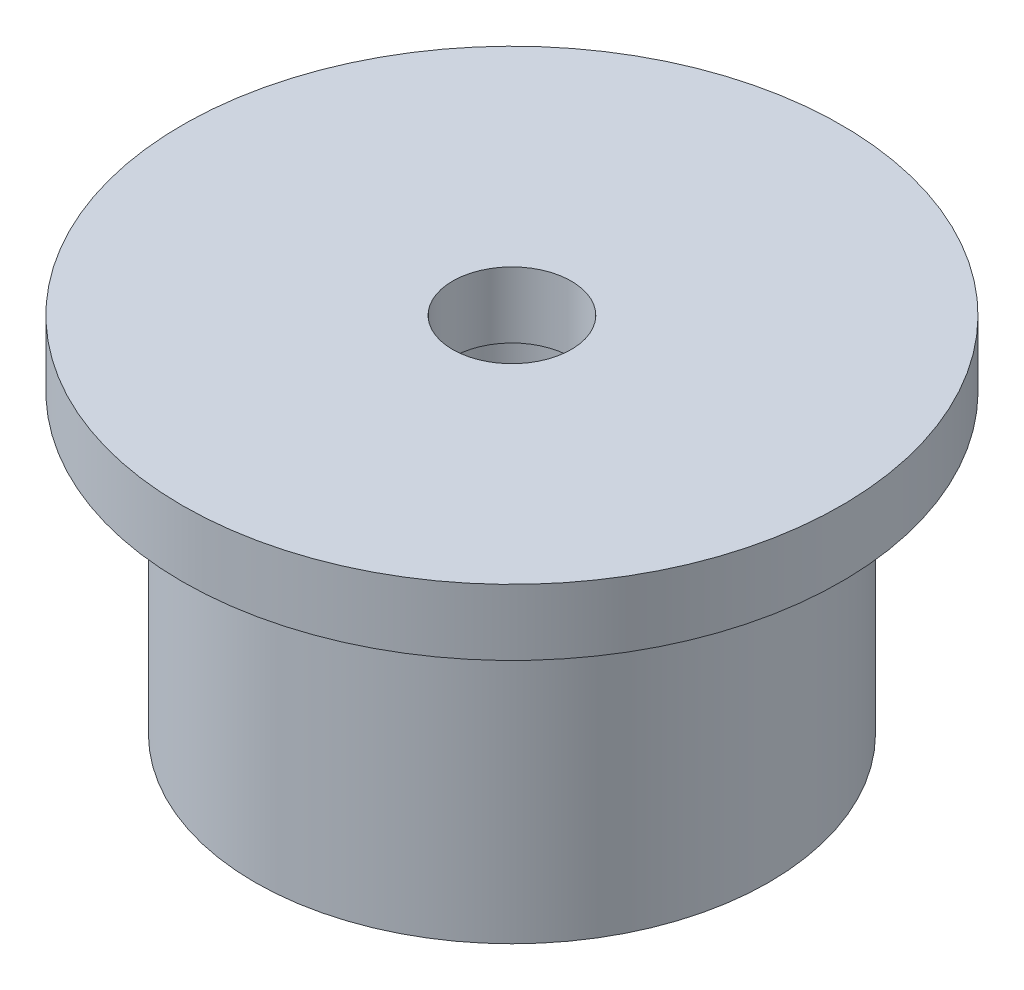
from build123d import *

# Parameters (mm, degrees)
SKETCH1_R           = 5
BOSS_EXTRUDE1_DEPTH = 0.5
SKETCH2_R           = 3.9
BOSS_EXTRUDE2_DEPTH = 4.5
SKETCH4_R           = 1
CUT_EXTRUDE1_DEPTH  = 4.5
CUT_EXTRUDE2_REACH  = 10.958
SKETCH5_R           = 0.9
CHAMFER1_SIZE       = 0.2


with BuildPart() as part:
    # Sketch1 → Boss-Extrude1 (new, symmetric)
    with BuildSketch(Plane(origin=(0, 0, 0), x_dir=(1, 0, 0), z_dir=(0, 1, 0))):
        with Locations(Location((0, 0, 0), (0, 0, 270))):
            Circle(SKETCH1_R)
    extrude(amount=BOSS_EXTRUDE1_DEPTH, both=True)

    # Sketch2 → Boss-Extrude2 (add)
    with BuildSketch(Plane(origin=(0, -0.5, 0), x_dir=(-1, 0, 0), z_dir=(0, -1, 0))):
        with Locations(Location((0, 0, 0), (0, 0, 270))):
            Circle(SKETCH2_R)
    extrude(amount=BOSS_EXTRUDE2_DEPTH)

    # Sketch4 → Cut-Extrude1 (cut)
    with BuildSketch(Plane(origin=(0, -5, 0), x_dir=(-1, 0, 0), z_dir=(0, -1, 0))):
        with Locations(Location((0, 0, 0), (0, 0, 90))):
            Circle(SKETCH4_R)
    extrude(amount=-CUT_EXTRUDE1_DEPTH, mode=Mode.SUBTRACT)

    # Sketch5 → Cut-Extrude2 (cut, up to next)
    with BuildSketch(Plane(origin=(0, 0.5, 0), x_dir=(1, 0, 0), z_dir=(0, 1, 0)), mode=Mode.PRIVATE) as cut_extrude2_sk1:
        with Locations(Location((0, 0, 0), (0, 0, 270))):
            Circle(SKETCH5_R)
    cut_extrude2_tool1 = extrude(cut_extrude2_sk1.sketch, amount=-CUT_EXTRUDE2_REACH, mode=Mode.PRIVATE) & part.part
    add(cut_extrude2_tool1.solids().sort_by_distance((0, 0.5, 0))[0], mode=Mode.SUBTRACT)

    # Chamfer1
    chamfer1_edges = [part.edges().sort_by_distance(p)[0] for p in [
        (0, -5, 1),
    ]]
    chamfer(chamfer1_edges, length=CHAMFER1_SIZE)


solid = part.part
